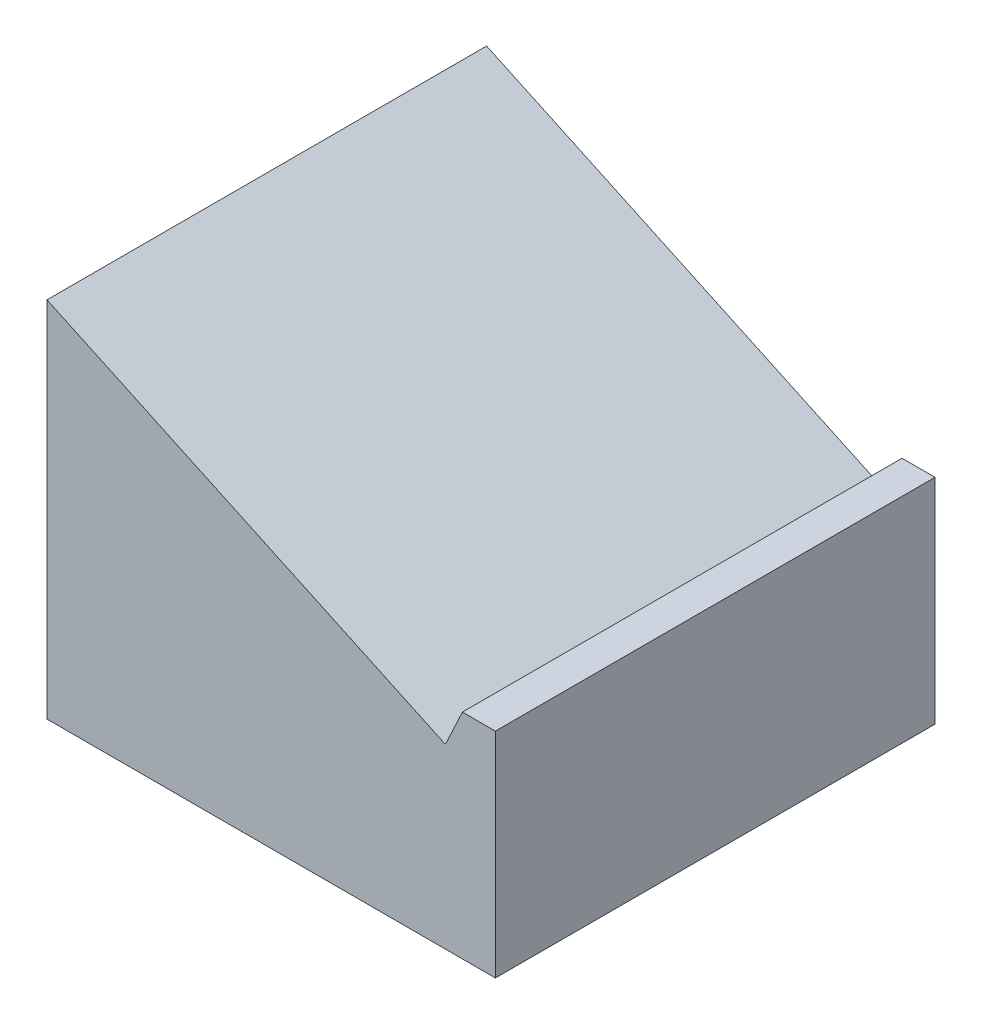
from build123d import *

# Parameters (mm, degrees)
EXTRUDE1_DEPTH = 25.4


with BuildPart() as part:
    # Sketch1 → Extrude1 (new body)
    with BuildSketch(Plane.XY):
        Polygon((-25.908, 20.9804), (-25.908, 0), (0, 0), (0, 12.353479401), (-1.905, 12.353479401), (-2.887782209, 10.245896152), align=None)
    extrude(amount=EXTRUDE1_DEPTH)


solid = part.part
